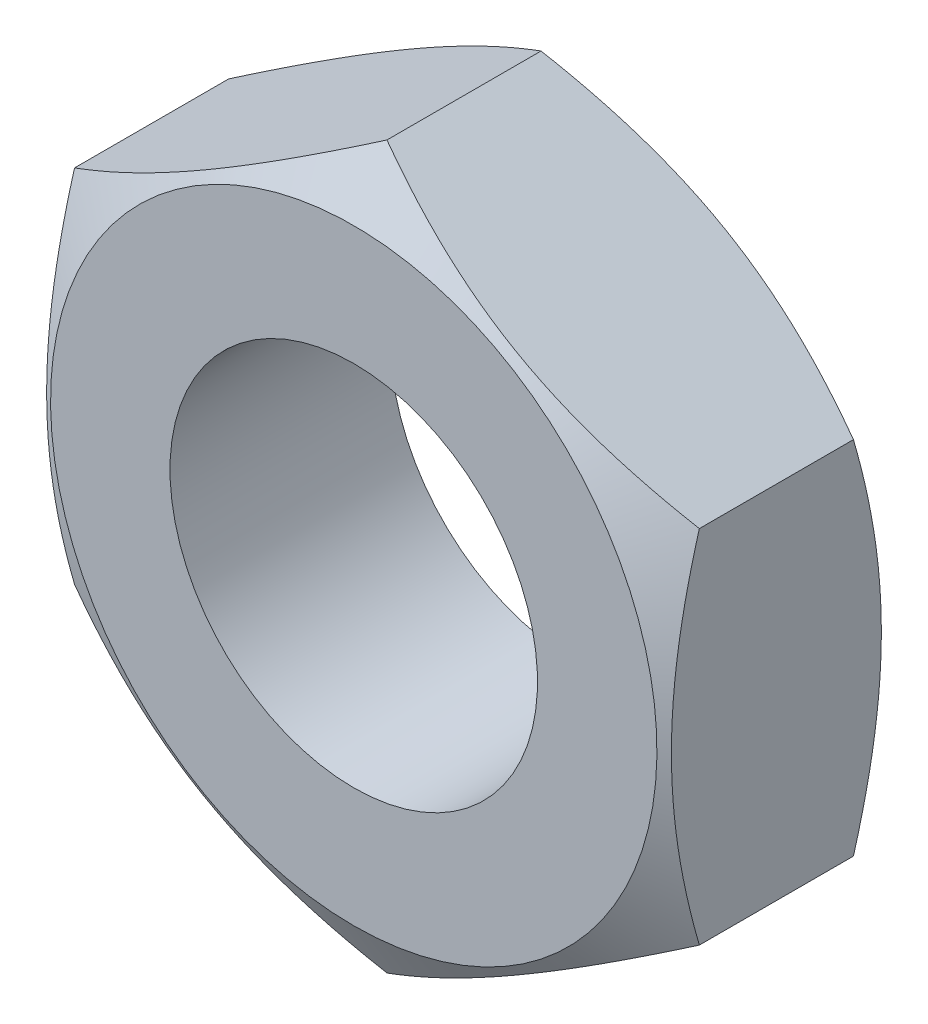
ISO-10303-21;
HEADER;
FILE_DESCRIPTION(('STEP AP214'),'2;1');
FILE_NAME('part.step','',(''),(''),'','','');
FILE_SCHEMA(('AUTOMOTIVE_DESIGN { 1 0 10303 214 1 1 1 1 }'));
ENDSEC;
DATA;
#1=APPLICATION_CONTEXT('core data for automotive mechanical design processes');
#2=APPLICATION_PROTOCOL_DEFINITION('international standard','automotive_design',2000,#1);
#3=PRODUCT_CONTEXT('',#1,'mechanical');
#4=PRODUCT('Part','Part','',(#3));
#5=PRODUCT_RELATED_PRODUCT_CATEGORY('part','',(#4));
#6=PRODUCT_DEFINITION_FORMATION('','',#4);
#7=PRODUCT_DEFINITION_CONTEXT('part definition',#1,'design');
#8=PRODUCT_DEFINITION('design','',#6,#7);
#9=PRODUCT_DEFINITION_SHAPE('','',#8);
#10=(LENGTH_UNIT() NAMED_UNIT(*) SI_UNIT(.MILLI.,.METRE.));
#11=(NAMED_UNIT(*) PLANE_ANGLE_UNIT() SI_UNIT($,.RADIAN.));
#12=(NAMED_UNIT(*) SI_UNIT($,.STERADIAN.) SOLID_ANGLE_UNIT());
#13=UNCERTAINTY_MEASURE_WITH_UNIT(LENGTH_MEASURE(1.E-05),#10,'distance_accuracy_value','');
#14=(GEOMETRIC_REPRESENTATION_CONTEXT(3) GLOBAL_UNCERTAINTY_ASSIGNED_CONTEXT((#13)) GLOBAL_UNIT_ASSIGNED_CONTEXT((#10,
#11,#12)) REPRESENTATION_CONTEXT('',''));
#15=CARTESIAN_POINT('',(0.,0.,0.));
#16=DIRECTION('',(0.,0.,1.));
#17=DIRECTION('',(1.,0.,0.));
#18=AXIS2_PLACEMENT_3D('',#15,#16,#17);
#19=CARTESIAN_POINT('',(-8.5,-4.90747728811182,8.));
#20=DIRECTION('',(-1.,0.,0.));
#21=DIRECTION('',(0.,0.,1.));
#22=AXIS2_PLACEMENT_3D('',#19,#20,#21);
#23=PLANE('',#22);
#24=CARTESIAN_POINT('',(-8.5,-13.2220103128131,1.68805373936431));
#25=CARTESIAN_POINT('',(-8.5,-12.8504235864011,1.86846678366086));
#26=CARTESIAN_POINT('',(-8.5,-12.4779881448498,2.04716148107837));
#27=CARTESIAN_POINT('',(-8.5,-11.7309686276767,2.40014855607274));
#28=CARTESIAN_POINT('',(-8.5,-11.356384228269,2.57444024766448));
#29=CARTESIAN_POINT('',(-8.5,-10.602704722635,2.91852400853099));
#30=CARTESIAN_POINT('',(-8.5,-10.2235961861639,3.08828676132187));
#31=CARTESIAN_POINT('',(-8.5,-9.46237784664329,3.42091824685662));
#32=CARTESIAN_POINT('',(-8.5,-9.08026818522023,3.5837873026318));
#33=CARTESIAN_POINT('',(-8.5,-8.29995060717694,3.90596922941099));
#34=CARTESIAN_POINT('',(-8.5,-7.90162321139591,4.06499431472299));
#35=CARTESIAN_POINT('',(-8.5,-7.10032398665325,4.37110535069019));
#36=CARTESIAN_POINT('',(-8.5,-6.69735164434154,4.51818996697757));
#37=CARTESIAN_POINT('',(-8.5,-5.88685796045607,4.79658764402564));
#38=CARTESIAN_POINT('',(-8.5,-5.47934758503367,4.927932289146));
#39=CARTESIAN_POINT('',(-8.5,-4.65849578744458,5.17066339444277));
#40=CARTESIAN_POINT('',(-8.5,-4.24515623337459,5.28205609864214));
#41=CARTESIAN_POINT('',(-8.5,-3.4146465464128,5.47896177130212));
#42=CARTESIAN_POINT('',(-8.5,-2.99751098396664,5.56461662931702));
#43=CARTESIAN_POINT('',(-8.5,-2.36797724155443,5.67010811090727));
#44=CARTESIAN_POINT('',(-8.5,-2.15747910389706,5.70144155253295));
#45=CARTESIAN_POINT('',(-8.5,-1.7354230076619,5.75583120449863));
#46=CARTESIAN_POINT('',(-8.5,-1.52386515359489,5.77888821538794));
#47=CARTESIAN_POINT('',(-8.5,-1.10275446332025,5.81597435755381));
#48=CARTESIAN_POINT('',(-8.5,-0.893211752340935,5.83011800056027));
#49=CARTESIAN_POINT('',(-8.5,-0.473715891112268,5.84952934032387));
#50=CARTESIAN_POINT('',(-8.5,-0.263762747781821,5.85479718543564));
#51=CARTESIAN_POINT('',(-8.5,0.156178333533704,5.85633113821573));
#52=CARTESIAN_POINT('',(-8.5,0.366166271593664,5.85259722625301));
#53=CARTESIAN_POINT('',(-8.5,0.785797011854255,5.83621947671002));
#54=CARTESIAN_POINT('',(-8.5,0.995439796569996,5.82357520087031));
#55=CARTESIAN_POINT('',(-8.5,1.49806512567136,5.78284710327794));
#56=CARTESIAN_POINT('',(-8.5,1.79071777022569,5.75060284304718));
#57=CARTESIAN_POINT('',(-8.5,2.37386344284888,5.6705007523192));
#58=CARTESIAN_POINT('',(-8.5,2.66435617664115,5.62264083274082));
#59=CARTESIAN_POINT('',(-8.5,3.53225535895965,5.45817427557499));
#60=CARTESIAN_POINT('',(-8.5,4.10576233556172,5.32071025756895));
#61=CARTESIAN_POINT('',(-8.5,4.96336295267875,5.08216925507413));
#62=CARTESIAN_POINT('',(-8.5,5.25190046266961,4.9961484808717));
#63=CARTESIAN_POINT('',(-8.5,5.82617341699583,4.81513030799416));
#64=CARTESIAN_POINT('',(-8.5,6.11190884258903,4.7201328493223));
#65=CARTESIAN_POINT('',(-8.5,6.68066668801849,4.52268903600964));
#66=CARTESIAN_POINT('',(-8.5,6.96368995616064,4.42024510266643));
#67=CARTESIAN_POINT('',(-8.5,7.52738867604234,4.2091179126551));
#68=CARTESIAN_POINT('',(-8.5,7.80806415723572,4.10043473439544));
#69=CARTESIAN_POINT('',(-8.5,8.47808910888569,3.83378477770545));
#70=CARTESIAN_POINT('',(-8.5,8.86645338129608,3.67334679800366));
#71=CARTESIAN_POINT('',(-8.5,9.63981277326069,3.34452258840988));
#72=CARTESIAN_POINT('',(-8.5,10.0248076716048,3.17613584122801));
#73=CARTESIAN_POINT('',(-8.5,10.7920682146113,2.83303130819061));
#74=CARTESIAN_POINT('',(-8.5,11.174333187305,2.65831202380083));
#75=CARTESIAN_POINT('',(-8.5,11.9365059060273,2.30384068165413));
#76=CARTESIAN_POINT('',(-8.5,12.3164137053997,2.12408873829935));
#77=CARTESIAN_POINT('',(-8.5,13.0747039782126,1.76030061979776));
#78=CARTESIAN_POINT('',(-8.5,13.4530842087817,1.57625977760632));
#79=CARTESIAN_POINT('',(-8.5,14.2081968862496,1.20482942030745));
#80=CARTESIAN_POINT('',(-8.5,14.5849293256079,1.01743988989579));
#81=CARTESIAN_POINT('',(-8.5,15.7129519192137,0.45120240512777));
#82=CARTESIAN_POINT('',(-8.5,16.4621734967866,0.068234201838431));
#83=CARTESIAN_POINT('',(-8.5,17.8924783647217,-0.672184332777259));
#84=CARTESIAN_POINT('',(-8.5,18.5738900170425,-1.02900322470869));
#85=CARTESIAN_POINT('',(-8.5,19.9341904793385,-1.74747618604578));
#86=CARTESIAN_POINT('',(-8.5,20.6130791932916,-2.10913043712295));
#87=CARTESIAN_POINT('',(-8.5,21.9671358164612,-2.83516945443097));
#88=CARTESIAN_POINT('',(-8.5,22.6423088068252,-3.19954475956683));
#89=CARTESIAN_POINT('',(-8.5,23.9910464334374,-3.93116924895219));
#90=CARTESIAN_POINT('',(-8.5,24.6646111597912,-4.29841826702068));
#91=CARTESIAN_POINT('',(-8.5,25.3375864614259,-4.66673700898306));
#92=B_SPLINE_CURVE_WITH_KNOTS('',3,(#24,#25,#26,#27,#28,#29,#30,#31,#32,#33,#34,#35,#36,#37,#38,
#39,#40,#41,#42,#43,#44,#45,#46,#47,#48,#49,#50,#51,#52,#53,#54,#55,#56,#57,#58,#59,#60,#61,#62,
#63,#64,#65,#66,#67,#68,#69,#70,#71,#72,#73,#74,#75,#76,#77,#78,#79,#80,#81,#82,#83,#84,#85,#86,
#87,#88,#89,#90,#91),.UNSPECIFIED.,.F.,.F.,(4,2,2,2,2,2,2,2,2,2,2,2,2,2,2,2,2,2,2,2,2,2,2,2,2,2,
2,2,2,2,2,2,2,4),(0.,1.23922034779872,2.47863258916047,3.72472525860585,4.97075947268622,
6.25730558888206,7.54399528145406,8.82805821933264,10.1117186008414,11.3881667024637,
12.0264818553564,12.6647352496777,13.2946121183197,13.9244784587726,14.5543461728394,
15.1842448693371,16.0670176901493,16.9499086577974,18.7166516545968,19.6198369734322,
20.5230283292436,21.425927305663,22.3288149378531,23.589291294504,24.8498497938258,
26.1107085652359,27.3715386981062,28.6338115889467,29.8960902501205,32.4202938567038,
34.7278204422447,37.0354339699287,39.3370893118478,41.6386125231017),.UNSPECIFIED.);
#93=CARTESIAN_POINT('',(-8.5,4.90747728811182,5.09647305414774));
#94=VERTEX_POINT('',#93);
#95=CARTESIAN_POINT('',(-8.5,-4.90747728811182,5.09647305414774));
#96=VERTEX_POINT('',#95);
#97=EDGE_CURVE('E74',#94,#96,#92,.F.);
#98=ORIENTED_EDGE('',*,*,#97,.F.);
#99=DIRECTION('',(0.,0.,-1.));
#100=VECTOR('',#99,1.);
#101=CARTESIAN_POINT('',(-8.5,4.90747728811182,8.));
#102=LINE('',#101,#100);
#103=CARTESIAN_POINT('',(-8.5,4.90747728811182,0.903526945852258));
#104=VERTEX_POINT('',#103);
#105=EDGE_CURVE('E43',#94,#104,#102,.T.);
#106=ORIENTED_EDGE('',*,*,#105,.T.);
#107=CARTESIAN_POINT('',(-8.5,-13.217348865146,4.30968253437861));
#108=CARTESIAN_POINT('',(-8.5,-12.8458016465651,4.1293073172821));
#109=CARTESIAN_POINT('',(-8.5,-12.4734053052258,3.95065142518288));
#110=CARTESIAN_POINT('',(-8.5,-11.7264629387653,3.59774455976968));
#111=CARTESIAN_POINT('',(-8.5,-11.3519165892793,3.42349427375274));
#112=CARTESIAN_POINT('',(-8.5,-10.598309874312,3.07949578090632));
#113=CARTESIAN_POINT('',(-8.5,-10.2192360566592,2.90977694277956));
#114=CARTESIAN_POINT('',(-8.5,-9.45808580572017,2.57723767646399));
#115=CARTESIAN_POINT('',(-8.5,-9.07600951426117,2.41441692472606));
#116=CARTESIAN_POINT('',(-8.5,-8.29577621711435,2.09234631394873));
#117=CARTESIAN_POINT('',(-8.5,-7.89749985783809,1.93338400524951));
#118=CARTESIAN_POINT('',(-8.5,-7.09630157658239,1.62740499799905));
#119=CARTESIAN_POINT('',(-8.5,-6.69337914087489,1.48038963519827));
#120=CARTESIAN_POINT('',(-8.5,-5.88298561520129,1.20213853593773));
#121=CARTESIAN_POINT('',(-8.5,-5.47552550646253,1.07087115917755));
#122=CARTESIAN_POINT('',(-8.5,-4.65477495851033,0.828303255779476));
#123=CARTESIAN_POINT('',(-8.5,-4.24148638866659,0.716996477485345));
#124=CARTESIAN_POINT('',(-8.5,-3.4110781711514,0.520269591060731));
#125=CARTESIAN_POINT('',(-8.5,-2.99399303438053,0.434707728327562));
#126=CARTESIAN_POINT('',(-8.5,-2.36453907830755,0.329359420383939));
#127=CARTESIAN_POINT('',(-8.5,-2.15406819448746,0.298074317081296));
#128=CARTESIAN_POINT('',(-8.5,-1.7320683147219,0.243781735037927));
#129=CARTESIAN_POINT('',(-8.5,-1.52053942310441,0.220773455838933));
#130=CARTESIAN_POINT('',(-8.5,-1.09948590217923,0.183783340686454));
#131=CARTESIAN_POINT('',(-8.5,-0.889971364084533,0.169687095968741));
#132=CARTESIAN_POINT('',(-8.5,-0.470533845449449,0.150369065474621));
#133=CARTESIAN_POINT('',(-8.5,-0.260610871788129,0.145147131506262));
#134=CARTESIAN_POINT('',(-8.5,0.159267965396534,0.143702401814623));
#135=CARTESIAN_POINT('',(-8.5,0.369223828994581,0.147479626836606));
#136=CARTESIAN_POINT('',(-8.5,0.788788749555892,0.163940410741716));
#137=CARTESIAN_POINT('',(-8.5,0.998397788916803,0.176624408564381));
#138=CARTESIAN_POINT('',(-8.5,1.50108256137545,0.217454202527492));
#139=CARTESIAN_POINT('',(-8.5,1.793827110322,0.249766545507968));
#140=CARTESIAN_POINT('',(-8.5,2.37715285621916,0.330009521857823));
#141=CARTESIAN_POINT('',(-8.5,2.66773375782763,0.377942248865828));
#142=CARTESIAN_POINT('',(-8.5,3.53589346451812,0.542630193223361));
#143=CARTESIAN_POINT('',(-8.5,4.10956801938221,0.680245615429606));
#144=CARTESIAN_POINT('',(-8.5,4.96741250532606,0.919010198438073));
#145=CARTESIAN_POINT('',(-8.5,5.25602859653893,1.00510487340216));
#146=CARTESIAN_POINT('',(-8.5,5.83045786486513,1.18626877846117));
#147=CARTESIAN_POINT('',(-8.5,6.11627102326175,1.28133806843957));
#148=CARTESIAN_POINT('',(-8.5,6.68518369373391,1.47892313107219));
#149=CARTESIAN_POINT('',(-8.5,6.96828405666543,1.58143647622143));
#150=CARTESIAN_POINT('',(-8.5,7.53213698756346,1.79270023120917));
#151=CARTESIAN_POINT('',(-8.5,7.81288958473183,1.90145056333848));
#152=CARTESIAN_POINT('',(-8.5,8.48212780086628,2.1678721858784));
#153=CARTESIAN_POINT('',(-8.5,8.86963833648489,2.32798850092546));
#154=CARTESIAN_POINT('',(-8.5,9.64130597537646,2.65613130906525));
#155=CARTESIAN_POINT('',(-8.5,10.0254628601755,2.82415831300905));
#156=CARTESIAN_POINT('',(-8.5,10.7910586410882,3.16651606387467));
#157=CARTESIAN_POINT('',(-8.5,11.172496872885,3.34084829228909));
#158=CARTESIAN_POINT('',(-8.5,11.9330253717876,3.69452635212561));
#159=CARTESIAN_POINT('',(-8.5,12.3121156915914,3.87387207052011));
#160=CARTESIAN_POINT('',(-8.5,13.0687747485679,4.23683235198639));
#161=CARTESIAN_POINT('',(-8.5,13.4463412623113,4.42045154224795));
#162=CARTESIAN_POINT('',(-8.5,14.1998317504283,4.7910284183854));
#163=CARTESIAN_POINT('',(-8.5,14.5757557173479,4.9779861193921));
#164=CARTESIAN_POINT('',(-8.5,15.7013597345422,5.54291756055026));
#165=CARTESIAN_POINT('',(-8.5,16.448977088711,5.92500052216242));
#166=CARTESIAN_POINT('',(-8.5,17.8763952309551,6.6637998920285));
#167=CARTESIAN_POINT('',(-8.5,18.5565227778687,7.01988783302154));
#168=CARTESIAN_POINT('',(-8.5,19.9142584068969,7.73689269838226));
#169=CARTESIAN_POINT('',(-8.5,20.5918663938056,8.09780980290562));
#170=CARTESIAN_POINT('',(-8.5,21.9433746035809,8.82237697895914));
#171=CARTESIAN_POINT('',(-8.5,22.6172798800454,9.18601763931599));
#172=CARTESIAN_POINT('',(-8.5,23.963483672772,9.91617087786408));
#173=CARTESIAN_POINT('',(-8.5,24.6357822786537,10.2826832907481));
#174=CARTESIAN_POINT('',(-8.5,25.3074917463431,10.6502650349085));
#175=B_SPLINE_CURVE_WITH_KNOTS('',3,(#107,#108,#109,#110,#111,#112,#113,#114,#115,#116,#117,
#118,#119,#120,#121,#122,#123,#124,#125,#126,#127,#128,#129,#130,#131,#132,#133,#134,#135,#136,
#137,#138,#139,#140,#141,#142,#143,#144,#145,#146,#147,#148,#149,#150,#151,#152,#153,#154,#155,
#156,#157,#158,#159,#160,#161,#162,#163,#164,#165,#166,#167,#168,#169,#170,#171,#172,#173,#174),
.UNSPECIFIED.,.F.,.F.,(4,2,2,2,2,2,2,2,2,2,2,2,2,2,2,2,2,2,2,2,2,2,2,2,2,2,2,2,2,2,2,2,2,4),(0.,
1.23906418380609,2.47832048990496,3.7242641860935,4.97014937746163,6.25648329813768,
7.54296084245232,8.82680874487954,10.1102538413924,11.3864970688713,12.0247099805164,
12.6628611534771,13.2926441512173,13.9224166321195,14.5521905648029,15.1819955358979,
16.0650645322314,16.9482519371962,18.7155902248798,19.6190649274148,20.5225456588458,
21.4257330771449,22.3289092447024,23.5866510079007,24.8444741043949,26.1025946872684,
27.3606869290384,28.6202113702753,29.8797415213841,32.3984513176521,34.7015479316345,
37.0047307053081,39.3019924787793,41.599122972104),.UNSPECIFIED.);
#176=CARTESIAN_POINT('',(-8.5,-4.90747728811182,0.903526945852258));
#177=VERTEX_POINT('',#176);
#178=EDGE_CURVE('E92',#177,#104,#175,.T.);
#179=ORIENTED_EDGE('',*,*,#178,.F.);
#180=DIRECTION('',(0.,0.,-1.));
#181=VECTOR('',#180,1.);
#182=CARTESIAN_POINT('',(-8.5,-4.90747728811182,8.));
#183=LINE('',#182,#181);
#184=EDGE_CURVE('E29',#96,#177,#183,.T.);
#185=ORIENTED_EDGE('',*,*,#184,.F.);
#186=EDGE_LOOP('',(#98,#106,#179,#185));
#187=FACE_BOUND('',#186,.T.);
#188=ADVANCED_FACE('F14',(#187),#23,.T.);
#189=CARTESIAN_POINT('',(-8.5,-4.90747728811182,8.));
#190=DIRECTION('',(0.5,0.866025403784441,0.));
#191=DIRECTION('',(-0.866025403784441,0.5,0.));
#192=AXIS2_PLACEMENT_3D('',#189,#190,#191);
#193=PLANE('',#192);
#194=DIRECTION('',(0.,0.,-1.));
#195=VECTOR('',#194,1.);
#196=CARTESIAN_POINT('',(0.,-9.81495457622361,8.));
#197=LINE('',#196,#195);
#198=CARTESIAN_POINT('',(0.,-9.81495457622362,5.09647305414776));
#199=VERTEX_POINT('',#198);
#200=CARTESIAN_POINT('',(0.,-9.81495457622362,0.903526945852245));
#201=VERTEX_POINT('',#200);
#202=EDGE_CURVE('E99',#199,#201,#197,.T.);
#203=ORIENTED_EDGE('',*,*,#202,.F.);
#204=CARTESIAN_POINT('',(0.000200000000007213,-9.81507004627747,5.09640638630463));
#205=CARTESIAN_POINT('',(-0.186639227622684,-9.70719836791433,5.15867629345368));
#206=CARTESIAN_POINT('',(-0.37417505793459,-9.59892450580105,5.21812013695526));
#207=CARTESIAN_POINT('',(-0.750769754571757,-9.38149745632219,5.33057732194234));
#208=CARTESIAN_POINT('',(-0.939829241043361,-9.27234391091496,5.38358788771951));
#209=CARTESIAN_POINT('',(-1.51003475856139,-8.94313560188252,5.53192904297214));
#210=CARTESIAN_POINT('',(-1.89343164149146,-8.72178130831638,5.61630350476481));
#211=CARTESIAN_POINT('',(-2.46717766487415,-8.39052888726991,5.71524241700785));
#212=CARTESIAN_POINT('',(-2.65581276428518,-8.28162036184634,5.7434272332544));
#213=CARTESIAN_POINT('',(-3.03393602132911,-8.06331079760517,5.7906883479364));
#214=CARTESIAN_POINT('',(-3.22342410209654,-7.95390980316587,5.80976545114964));
#215=CARTESIAN_POINT('',(-3.6027265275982,-7.73491944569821,5.8383276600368));
#216=CARTESIAN_POINT('',(-3.79254025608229,-7.62533043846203,5.84782365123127));
#217=CARTESIAN_POINT('',(-4.17234305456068,-7.40605119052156,5.85702005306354));
#218=CARTESIAN_POINT('',(-4.36233211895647,-7.29636095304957,5.85672076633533));
#219=CARTESIAN_POINT('',(-4.71752301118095,-7.09129139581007,5.84700795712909));
#220=CARTESIAN_POINT('',(-4.8827499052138,-6.99589760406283,5.83877926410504));
#221=CARTESIAN_POINT('',(-5.21281671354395,-6.80533344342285,5.81507319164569));
#222=CARTESIAN_POINT('',(-5.37765660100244,-6.71016309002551,5.79959532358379));
#223=CARTESIAN_POINT('',(-5.87153810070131,-6.42502047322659,5.74265381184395));
#224=CARTESIAN_POINT('',(-6.19970550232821,-6.23555293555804,5.69068937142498));
#225=CARTESIAN_POINT('',(-6.85952142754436,-5.8546080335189,5.56077749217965));
#226=CARTESIAN_POINT('',(-7.19108574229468,-5.66317928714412,5.48227936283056));
#227=CARTESIAN_POINT('',(-7.84926989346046,-5.28317649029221,5.30412109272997));
#228=CARTESIAN_POINT('',(-8.17589815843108,-5.09459757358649,5.20450279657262));
#229=CARTESIAN_POINT('',(-8.5002,-4.90736181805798,5.09640638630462));
#230=B_SPLINE_CURVE_WITH_KNOTS('',3,(#204,#205,#206,#207,#208,#209,#210,#211,#212,#213,#214,
#215,#216,#217,#218,#219,#220,#221,#222,#223,#224,#225,#226,#227,#228,#229),.UNSPECIFIED.,.F.,
.F.,(4,2,2,2,2,2,2,2,2,2,2,2,4),(0.,0.673596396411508,1.34748239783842,2.69805431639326,
3.356799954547,4.01548737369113,4.67342558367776,5.33134346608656,5.9040955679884,
6.47688628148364,7.62328361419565,8.79510569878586,9.96462743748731),.UNSPECIFIED.);
#231=EDGE_CURVE('E80',#199,#96,#230,.T.);
#232=ORIENTED_EDGE('',*,*,#231,.T.);
#233=ORIENTED_EDGE('',*,*,#184,.T.);
#234=CARTESIAN_POINT('',(-8.5002,-4.90736181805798,0.90359361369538));
#235=CARTESIAN_POINT('',(-8.31336077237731,-5.01523349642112,0.841323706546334));
#236=CARTESIAN_POINT('',(-8.1258249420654,-5.1235073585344,0.781879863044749));
#237=CARTESIAN_POINT('',(-7.74923024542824,-5.34093440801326,0.669422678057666));
#238=CARTESIAN_POINT('',(-7.56017075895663,-5.45008795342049,0.616412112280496));
#239=CARTESIAN_POINT('',(-6.9899652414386,-5.77929626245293,0.468070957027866));
#240=CARTESIAN_POINT('',(-6.60656835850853,-6.00065055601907,0.383696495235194));
#241=CARTESIAN_POINT('',(-6.03282233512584,-6.33190297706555,0.284757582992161));
#242=CARTESIAN_POINT('',(-5.84418723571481,-6.44081150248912,0.256572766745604));
#243=CARTESIAN_POINT('',(-5.46606397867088,-6.65912106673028,0.209311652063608));
#244=CARTESIAN_POINT('',(-5.27657589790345,-6.76852206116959,0.190234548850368));
#245=CARTESIAN_POINT('',(-4.89727347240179,-6.98751241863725,0.161672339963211));
#246=CARTESIAN_POINT('',(-4.7074597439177,-7.09710142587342,0.15217634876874));
#247=CARTESIAN_POINT('',(-4.32765694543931,-7.3163806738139,0.14297994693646));
#248=CARTESIAN_POINT('',(-4.13766788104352,-7.42607091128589,0.143279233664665));
#249=CARTESIAN_POINT('',(-3.78247698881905,-7.63114046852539,0.15299204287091));
#250=CARTESIAN_POINT('',(-3.6172500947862,-7.72653426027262,0.161220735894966));
#251=CARTESIAN_POINT('',(-3.28718328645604,-7.9170984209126,0.184926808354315));
#252=CARTESIAN_POINT('',(-3.12234339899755,-8.01226877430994,0.200404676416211));
#253=CARTESIAN_POINT('',(-2.62846189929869,-8.29741139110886,0.257346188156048));
#254=CARTESIAN_POINT('',(-2.30029449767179,-8.48687892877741,0.309310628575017));
#255=CARTESIAN_POINT('',(-1.64047857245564,-8.86782383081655,0.439222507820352));
#256=CARTESIAN_POINT('',(-1.30891425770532,-9.05925257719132,0.517720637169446));
#257=CARTESIAN_POINT('',(-0.650730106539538,-9.43925537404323,0.695878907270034));
#258=CARTESIAN_POINT('',(-0.324101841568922,-9.62783429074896,0.79549720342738));
#259=CARTESIAN_POINT('',(0.000199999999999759,-9.81507004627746,0.903593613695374));
#260=B_SPLINE_CURVE_WITH_KNOTS('',3,(#234,#235,#236,#237,#238,#239,#240,#241,#242,#243,#244,
#245,#246,#247,#248,#249,#250,#251,#252,#253,#254,#255,#256,#257,#258,#259),.UNSPECIFIED.,.F.,
.F.,(4,2,2,2,2,2,2,2,2,2,2,2,4),(0.,0.673596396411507,1.34748239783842,2.69805431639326,
3.356799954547,4.01548737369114,4.67342558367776,5.33134346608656,5.9040955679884,
6.47688628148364,7.62328361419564,8.79510569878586,9.96462743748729),.UNSPECIFIED.);
#261=EDGE_CURVE('E164',#177,#201,#260,.T.);
#262=ORIENTED_EDGE('',*,*,#261,.T.);
#263=EDGE_LOOP('',(#203,#232,#233,#262));
#264=FACE_BOUND('',#263,.T.);
#265=ADVANCED_FACE('F16',(#264),#193,.F.);
#266=CARTESIAN_POINT('',(8.5,-4.90747728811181,8.));
#267=DIRECTION('',(0.5,-0.86602540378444,0.));
#268=DIRECTION('',(0.86602540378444,0.5,0.));
#269=AXIS2_PLACEMENT_3D('',#266,#267,#268);
#270=PLANE('',#269);
#271=CARTESIAN_POINT('',(-0.000199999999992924,-9.81507004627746,5.09640638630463));
#272=CARTESIAN_POINT('',(0.186639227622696,-9.70719836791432,5.15867629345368));
#273=CARTESIAN_POINT('',(0.374175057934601,-9.59892450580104,5.21812013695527));
#274=CARTESIAN_POINT('',(0.750769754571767,-9.38149745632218,5.33057732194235));
#275=CARTESIAN_POINT('',(0.939829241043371,-9.27234391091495,5.38358788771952));
#276=CARTESIAN_POINT('',(1.5100347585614,-8.94313560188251,5.53192904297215));
#277=CARTESIAN_POINT('',(1.89343164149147,-8.72178130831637,5.61630350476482));
#278=CARTESIAN_POINT('',(2.46717766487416,-8.39052888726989,5.71524241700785));
#279=CARTESIAN_POINT('',(2.65581276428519,-8.28162036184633,5.74342723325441));
#280=CARTESIAN_POINT('',(3.03393602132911,-8.06331079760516,5.7906883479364));
#281=CARTESIAN_POINT('',(3.22342410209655,-7.95390980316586,5.80976545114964));
#282=CARTESIAN_POINT('',(3.60272652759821,-7.7349194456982,5.8383276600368));
#283=CARTESIAN_POINT('',(3.7925402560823,-7.62533043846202,5.84782365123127));
#284=CARTESIAN_POINT('',(4.17234305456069,-7.40605119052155,5.85702005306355));
#285=CARTESIAN_POINT('',(4.36233211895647,-7.29636095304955,5.85672076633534));
#286=CARTESIAN_POINT('',(4.71752301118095,-7.09129139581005,5.8470079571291));
#287=CARTESIAN_POINT('',(4.8827499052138,-6.99589760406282,5.83877926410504));
#288=CARTESIAN_POINT('',(5.21281671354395,-6.80533344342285,5.81507319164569));
#289=CARTESIAN_POINT('',(5.37765660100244,-6.7101630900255,5.7995953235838));
#290=CARTESIAN_POINT('',(5.87153810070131,-6.42502047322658,5.74265381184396));
#291=CARTESIAN_POINT('',(6.19970550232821,-6.23555293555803,5.69068937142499));
#292=CARTESIAN_POINT('',(6.85952142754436,-5.85460803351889,5.56077749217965));
#293=CARTESIAN_POINT('',(7.19108574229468,-5.66317928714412,5.48227936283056));
#294=CARTESIAN_POINT('',(7.84926989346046,-5.2831764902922,5.30412109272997));
#295=CARTESIAN_POINT('',(8.17589815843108,-5.09459757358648,5.20450279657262));
#296=CARTESIAN_POINT('',(8.5002,-4.90736181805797,5.09640638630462));
#297=B_SPLINE_CURVE_WITH_KNOTS('',3,(#271,#272,#273,#274,#275,#276,#277,#278,#279,#280,#281,
#282,#283,#284,#285,#286,#287,#288,#289,#290,#291,#292,#293,#294,#295,#296),.UNSPECIFIED.,.F.,
.F.,(4,2,2,2,2,2,2,2,2,2,2,2,4),(0.,0.673596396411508,1.34748239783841,2.69805431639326,
3.356799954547,4.01548737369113,4.67342558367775,5.33134346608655,5.90409556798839,
6.47688628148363,7.62328361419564,8.79510569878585,9.96462743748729),.UNSPECIFIED.);
#298=CARTESIAN_POINT('',(8.5,-4.90747728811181,5.09647305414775));
#299=VERTEX_POINT('',#298);
#300=EDGE_CURVE('E135',#199,#299,#297,.T.);
#301=ORIENTED_EDGE('',*,*,#300,.F.);
#302=ORIENTED_EDGE('',*,*,#202,.T.);
#303=CARTESIAN_POINT('',(8.5002,-4.90736181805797,0.903593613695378));
#304=CARTESIAN_POINT('',(8.31336077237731,-5.01523349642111,0.841323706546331));
#305=CARTESIAN_POINT('',(8.1258249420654,-5.12350735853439,0.781879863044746));
#306=CARTESIAN_POINT('',(7.74923024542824,-5.34093440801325,0.669422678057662));
#307=CARTESIAN_POINT('',(7.56017075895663,-5.45008795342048,0.616412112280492));
#308=CARTESIAN_POINT('',(6.9899652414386,-5.77929626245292,0.468070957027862));
#309=CARTESIAN_POINT('',(6.60656835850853,-6.00065055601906,0.38369649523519));
#310=CARTESIAN_POINT('',(6.03282233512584,-6.33190297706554,0.284757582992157));
#311=CARTESIAN_POINT('',(5.84418723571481,-6.44081150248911,0.2565727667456));
#312=CARTESIAN_POINT('',(5.46606397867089,-6.65912106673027,0.209311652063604));
#313=CARTESIAN_POINT('',(5.27657589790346,-6.76852206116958,0.190234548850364));
#314=CARTESIAN_POINT('',(4.8972734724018,-6.98751241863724,0.161672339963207));
#315=CARTESIAN_POINT('',(4.7074597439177,-7.09710142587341,0.152176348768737));
#316=CARTESIAN_POINT('',(4.32765694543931,-7.31638067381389,0.142979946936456));
#317=CARTESIAN_POINT('',(4.13766788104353,-7.42607091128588,0.143279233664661));
#318=CARTESIAN_POINT('',(3.78247698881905,-7.63114046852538,0.152992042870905));
#319=CARTESIAN_POINT('',(3.6172500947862,-7.72653426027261,0.161220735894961));
#320=CARTESIAN_POINT('',(3.28718328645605,-7.91709842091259,0.18492680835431));
#321=CARTESIAN_POINT('',(3.12234339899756,-8.01226877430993,0.200404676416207));
#322=CARTESIAN_POINT('',(2.62846189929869,-8.29741139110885,0.257346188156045));
#323=CARTESIAN_POINT('',(2.30029449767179,-8.4868789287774,0.309310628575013));
#324=CARTESIAN_POINT('',(1.64047857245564,-8.86782383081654,0.439222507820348));
#325=CARTESIAN_POINT('',(1.30891425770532,-9.05925257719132,0.517720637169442));
#326=CARTESIAN_POINT('',(0.650730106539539,-9.43925537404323,0.695878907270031));
#327=CARTESIAN_POINT('',(0.324101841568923,-9.62783429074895,0.795497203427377));
#328=CARTESIAN_POINT('',(-0.000199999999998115,-9.81507004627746,0.903593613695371));
#329=B_SPLINE_CURVE_WITH_KNOTS('',3,(#303,#304,#305,#306,#307,#308,#309,#310,#311,#312,#313,
#314,#315,#316,#317,#318,#319,#320,#321,#322,#323,#324,#325,#326,#327,#328),.UNSPECIFIED.,.F.,
.F.,(4,2,2,2,2,2,2,2,2,2,2,2,4),(0.,0.673596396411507,1.34748239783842,2.69805431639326,
3.356799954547,4.01548737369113,4.67342558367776,5.33134346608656,5.9040955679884,
6.47688628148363,7.62328361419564,8.79510569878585,9.96462743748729),.UNSPECIFIED.);
#330=CARTESIAN_POINT('',(8.5,-4.90747728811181,0.903526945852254));
#331=VERTEX_POINT('',#330);
#332=EDGE_CURVE('E196',#331,#201,#329,.T.);
#333=ORIENTED_EDGE('',*,*,#332,.F.);
#334=DIRECTION('',(0.,0.,-1.));
#335=VECTOR('',#334,1.);
#336=CARTESIAN_POINT('',(8.5,-4.90747728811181,8.));
#337=LINE('',#336,#335);
#338=EDGE_CURVE('E97',#299,#331,#337,.T.);
#339=ORIENTED_EDGE('',*,*,#338,.F.);
#340=EDGE_LOOP('',(#301,#302,#333,#339));
#341=FACE_BOUND('',#340,.T.);
#342=ADVANCED_FACE('F202',(#341),#270,.T.);
#343=CARTESIAN_POINT('',(8.5,-4.90747728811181,8.));
#344=DIRECTION('',(-1.,0.,0.));
#345=DIRECTION('',(0.,0.,1.));
#346=AXIS2_PLACEMENT_3D('',#343,#344,#345);
#347=PLANE('',#346);
#348=DIRECTION('',(0.,0.,-1.));
#349=VECTOR('',#348,1.);
#350=CARTESIAN_POINT('',(8.5,4.90747728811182,8.));
#351=LINE('',#350,#349);
#352=CARTESIAN_POINT('',(8.5,4.90747728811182,5.09647305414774));
#353=VERTEX_POINT('',#352);
#354=CARTESIAN_POINT('',(8.5,4.90747728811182,0.903526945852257));
#355=VERTEX_POINT('',#354);
#356=EDGE_CURVE('E89',#353,#355,#351,.T.);
#357=ORIENTED_EDGE('',*,*,#356,.F.);
#358=CARTESIAN_POINT('',(8.5,-13.2220103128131,1.68805373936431));
#359=CARTESIAN_POINT('',(8.5,-12.8504235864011,1.86846678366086));
#360=CARTESIAN_POINT('',(8.5,-12.4779881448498,2.04716148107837));
#361=CARTESIAN_POINT('',(8.5,-11.7309686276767,2.40014855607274));
#362=CARTESIAN_POINT('',(8.5,-11.356384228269,2.57444024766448));
#363=CARTESIAN_POINT('',(8.5,-10.602704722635,2.91852400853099));
#364=CARTESIAN_POINT('',(8.5,-10.2235961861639,3.08828676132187));
#365=CARTESIAN_POINT('',(8.5,-9.46237784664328,3.42091824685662));
#366=CARTESIAN_POINT('',(8.5,-9.08026818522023,3.5837873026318));
#367=CARTESIAN_POINT('',(8.5,-8.29995060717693,3.90596922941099));
#368=CARTESIAN_POINT('',(8.5,-7.90162321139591,4.064994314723));
#369=CARTESIAN_POINT('',(8.5,-7.10032398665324,4.37110535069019));
#370=CARTESIAN_POINT('',(8.5,-6.69735164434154,4.51818996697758));
#371=CARTESIAN_POINT('',(8.5,-5.88685796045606,4.79658764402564));
#372=CARTESIAN_POINT('',(8.5,-5.47934758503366,4.927932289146));
#373=CARTESIAN_POINT('',(8.5,-4.65849578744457,5.17066339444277));
#374=CARTESIAN_POINT('',(8.5,-4.24515623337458,5.28205609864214));
#375=CARTESIAN_POINT('',(8.5,-3.41464654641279,5.47896177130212));
#376=CARTESIAN_POINT('',(8.5,-2.99751098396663,5.56461662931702));
#377=CARTESIAN_POINT('',(8.5,-2.36797724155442,5.67010811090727));
#378=CARTESIAN_POINT('',(8.5,-2.15747910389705,5.70144155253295));
#379=CARTESIAN_POINT('',(8.5,-1.73542300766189,5.75583120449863));
#380=CARTESIAN_POINT('',(8.5,-1.52386515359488,5.77888821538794));
#381=CARTESIAN_POINT('',(8.5,-1.10275446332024,5.81597435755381));
#382=CARTESIAN_POINT('',(8.5,-0.893211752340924,5.83011800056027));
#383=CARTESIAN_POINT('',(8.5,-0.473715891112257,5.84952934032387));
#384=CARTESIAN_POINT('',(8.5,-0.26376274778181,5.85479718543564));
#385=CARTESIAN_POINT('',(8.5,0.156178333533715,5.85633113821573));
#386=CARTESIAN_POINT('',(8.5,0.366166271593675,5.85259722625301));
#387=CARTESIAN_POINT('',(8.5,0.785797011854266,5.83621947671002));
#388=CARTESIAN_POINT('',(8.5,0.995439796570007,5.82357520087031));
#389=CARTESIAN_POINT('',(8.5,1.49806512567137,5.78284710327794));
#390=CARTESIAN_POINT('',(8.5,1.7907177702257,5.75060284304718));
#391=CARTESIAN_POINT('',(8.5,2.37386344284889,5.6705007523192));
#392=CARTESIAN_POINT('',(8.5,2.66435617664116,5.62264083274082));
#393=CARTESIAN_POINT('',(8.5,3.53225535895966,5.45817427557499));
#394=CARTESIAN_POINT('',(8.5,4.10576233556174,5.32071025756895));
#395=CARTESIAN_POINT('',(8.5,4.96336295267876,5.08216925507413));
#396=CARTESIAN_POINT('',(8.5,5.25190046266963,4.99614848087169));
#397=CARTESIAN_POINT('',(8.5,5.82617341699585,4.81513030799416));
#398=CARTESIAN_POINT('',(8.5,6.11190884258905,4.72013284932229));
#399=CARTESIAN_POINT('',(8.5,6.68066668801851,4.52268903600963));
#400=CARTESIAN_POINT('',(8.5,6.96368995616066,4.42024510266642));
#401=CARTESIAN_POINT('',(8.5,7.52738867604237,4.20911791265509));
#402=CARTESIAN_POINT('',(8.5,7.80806415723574,4.10043473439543));
#403=CARTESIAN_POINT('',(8.5,8.47808910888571,3.83378477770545));
#404=CARTESIAN_POINT('',(8.5,8.8664533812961,3.67334679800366));
#405=CARTESIAN_POINT('',(8.5,9.63981277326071,3.34452258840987));
#406=CARTESIAN_POINT('',(8.5,10.0248076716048,3.17613584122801));
#407=CARTESIAN_POINT('',(8.5,10.7920682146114,2.83303130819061));
#408=CARTESIAN_POINT('',(8.5,11.174333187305,2.65831202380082));
#409=CARTESIAN_POINT('',(8.5,11.9365059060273,2.30384068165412));
#410=CARTESIAN_POINT('',(8.5,12.3164137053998,2.12408873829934));
#411=CARTESIAN_POINT('',(8.5,13.0747039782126,1.76030061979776));
#412=CARTESIAN_POINT('',(8.5,13.4530842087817,1.57625977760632));
#413=CARTESIAN_POINT('',(8.5,14.2081968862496,1.20482942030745));
#414=CARTESIAN_POINT('',(8.5,14.5849293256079,1.01743988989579));
#415=CARTESIAN_POINT('',(8.5,15.7129519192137,0.451202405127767));
#416=CARTESIAN_POINT('',(8.5,16.4621734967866,0.0682342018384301));
#417=CARTESIAN_POINT('',(8.5,17.8924783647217,-0.672184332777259));
#418=CARTESIAN_POINT('',(8.5,18.5738900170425,-1.02900322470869));
#419=CARTESIAN_POINT('',(8.5,19.9341904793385,-1.74747618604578));
#420=CARTESIAN_POINT('',(8.5,20.6130791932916,-2.10913043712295));
#421=CARTESIAN_POINT('',(8.5,21.9671358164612,-2.83516945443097));
#422=CARTESIAN_POINT('',(8.5,22.6423088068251,-3.19954475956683));
#423=CARTESIAN_POINT('',(8.5,23.9910464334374,-3.93116924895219));
#424=CARTESIAN_POINT('',(8.5,24.6646111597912,-4.29841826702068));
#425=CARTESIAN_POINT('',(8.5,25.3375864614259,-4.66673700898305));
#426=B_SPLINE_CURVE_WITH_KNOTS('',3,(#358,#359,#360,#361,#362,#363,#364,#365,#366,#367,#368,
#369,#370,#371,#372,#373,#374,#375,#376,#377,#378,#379,#380,#381,#382,#383,#384,#385,#386,#387,
#388,#389,#390,#391,#392,#393,#394,#395,#396,#397,#398,#399,#400,#401,#402,#403,#404,#405,#406,
#407,#408,#409,#410,#411,#412,#413,#414,#415,#416,#417,#418,#419,#420,#421,#422,#423,#424,#425),
.UNSPECIFIED.,.F.,.F.,(4,2,2,2,2,2,2,2,2,2,2,2,2,2,2,2,2,2,2,2,2,2,2,2,2,2,2,2,2,2,2,2,2,4),(0.,
1.23922034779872,2.47863258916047,3.72472525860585,4.97075947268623,6.25730558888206,
7.54399528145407,8.82805821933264,10.1117186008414,11.3881667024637,12.0264818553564,
12.6647352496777,13.2946121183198,13.9244784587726,14.5543461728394,15.1842448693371,
16.0670176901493,16.9499086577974,18.7166516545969,19.6198369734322,20.5230283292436,
21.4259273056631,22.3288149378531,23.589291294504,24.8498497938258,26.1107085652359,
27.3715386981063,28.6338115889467,29.8960902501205,32.4202938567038,34.7278204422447,
37.0354339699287,39.3370893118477,41.6386125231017),.UNSPECIFIED.);
#427=EDGE_CURVE('E106',#353,#299,#426,.F.);
#428=ORIENTED_EDGE('',*,*,#427,.T.);
#429=ORIENTED_EDGE('',*,*,#338,.T.);
#430=CARTESIAN_POINT('',(8.5,-13.217348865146,4.3096825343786));
#431=CARTESIAN_POINT('',(8.5,-12.8458016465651,4.1293073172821));
#432=CARTESIAN_POINT('',(8.5,-12.4734053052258,3.95065142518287));
#433=CARTESIAN_POINT('',(8.5,-11.7264629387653,3.59774455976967));
#434=CARTESIAN_POINT('',(8.5,-11.3519165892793,3.42349427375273));
#435=CARTESIAN_POINT('',(8.5,-10.5983098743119,3.07949578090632));
#436=CARTESIAN_POINT('',(8.5,-10.2192360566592,2.90977694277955));
#437=CARTESIAN_POINT('',(8.5,-9.45808580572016,2.57723767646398));
#438=CARTESIAN_POINT('',(8.5,-9.07600951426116,2.41441692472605));
#439=CARTESIAN_POINT('',(8.5,-8.29577621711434,2.09234631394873));
#440=CARTESIAN_POINT('',(8.5,-7.89749985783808,1.9333840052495));
#441=CARTESIAN_POINT('',(8.5,-7.09630157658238,1.62740499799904));
#442=CARTESIAN_POINT('',(8.5,-6.69337914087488,1.48038963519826));
#443=CARTESIAN_POINT('',(8.5,-5.88298561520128,1.20213853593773));
#444=CARTESIAN_POINT('',(8.5,-5.47552550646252,1.07087115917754));
#445=CARTESIAN_POINT('',(8.5,-4.65477495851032,0.828303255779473));
#446=CARTESIAN_POINT('',(8.5,-4.24148638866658,0.716996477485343));
#447=CARTESIAN_POINT('',(8.5,-3.41107817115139,0.520269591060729));
#448=CARTESIAN_POINT('',(8.5,-2.99399303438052,0.43470772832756));
#449=CARTESIAN_POINT('',(8.5,-2.36453907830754,0.329359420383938));
#450=CARTESIAN_POINT('',(8.5,-2.15406819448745,0.298074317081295));
#451=CARTESIAN_POINT('',(8.5,-1.73206831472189,0.243781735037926));
#452=CARTESIAN_POINT('',(8.5,-1.5205394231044,0.220773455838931));
#453=CARTESIAN_POINT('',(8.5,-1.09948590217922,0.183783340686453));
#454=CARTESIAN_POINT('',(8.5,-0.889971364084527,0.169687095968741));
#455=CARTESIAN_POINT('',(8.5,-0.470533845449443,0.150369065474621));
#456=CARTESIAN_POINT('',(8.5,-0.260610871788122,0.145147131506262));
#457=CARTESIAN_POINT('',(8.5,0.159267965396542,0.143702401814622));
#458=CARTESIAN_POINT('',(8.5,0.36922382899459,0.147479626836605));
#459=CARTESIAN_POINT('',(8.5,0.7887887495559,0.163940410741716));
#460=CARTESIAN_POINT('',(8.5,0.998397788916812,0.176624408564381));
#461=CARTESIAN_POINT('',(8.5,1.50108256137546,0.217454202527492));
#462=CARTESIAN_POINT('',(8.5,1.79382711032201,0.249766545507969));
#463=CARTESIAN_POINT('',(8.5,2.37715285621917,0.330009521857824));
#464=CARTESIAN_POINT('',(8.5,2.66773375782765,0.377942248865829));
#465=CARTESIAN_POINT('',(8.5,3.53589346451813,0.542630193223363));
#466=CARTESIAN_POINT('',(8.5,4.10956801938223,0.680245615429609));
#467=CARTESIAN_POINT('',(8.5,4.96741250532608,0.919010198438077));
#468=CARTESIAN_POINT('',(8.5,5.25602859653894,1.00510487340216));
#469=CARTESIAN_POINT('',(8.5,5.83045786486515,1.18626877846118));
#470=CARTESIAN_POINT('',(8.5,6.11627102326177,1.28133806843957));
#471=CARTESIAN_POINT('',(8.5,6.68518369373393,1.4789231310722));
#472=CARTESIAN_POINT('',(8.5,6.96828405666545,1.58143647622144));
#473=CARTESIAN_POINT('',(8.5,7.53213698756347,1.79270023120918));
#474=CARTESIAN_POINT('',(8.5,7.81288958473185,1.90145056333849));
#475=CARTESIAN_POINT('',(8.5,8.4821278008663,2.1678721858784));
#476=CARTESIAN_POINT('',(8.5,8.86963833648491,2.32798850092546));
#477=CARTESIAN_POINT('',(8.5,9.64130597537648,2.65613130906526));
#478=CARTESIAN_POINT('',(8.5,10.0254628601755,2.82415831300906));
#479=CARTESIAN_POINT('',(8.5,10.7910586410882,3.16651606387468));
#480=CARTESIAN_POINT('',(8.5,11.172496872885,3.3408482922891));
#481=CARTESIAN_POINT('',(8.5,11.9330253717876,3.69452635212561));
#482=CARTESIAN_POINT('',(8.5,12.3121156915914,3.87387207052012));
#483=CARTESIAN_POINT('',(8.5,13.068774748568,4.2368323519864));
#484=CARTESIAN_POINT('',(8.5,13.4463412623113,4.42045154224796));
#485=CARTESIAN_POINT('',(8.5,14.1998317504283,4.79102841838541));
#486=CARTESIAN_POINT('',(8.5,14.5757557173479,4.9779861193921));
#487=CARTESIAN_POINT('',(8.5,15.7013597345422,5.54291756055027));
#488=CARTESIAN_POINT('',(8.5,16.448977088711,5.92500052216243));
#489=CARTESIAN_POINT('',(8.5,17.8763952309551,6.6637998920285));
#490=CARTESIAN_POINT('',(8.5,18.5565227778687,7.01988783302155));
#491=CARTESIAN_POINT('',(8.5,19.9142584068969,7.73689269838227));
#492=CARTESIAN_POINT('',(8.5,20.5918663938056,8.09780980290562));
#493=CARTESIAN_POINT('',(8.5,21.9433746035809,8.82237697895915));
#494=CARTESIAN_POINT('',(8.5,22.6172798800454,9.186017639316));
#495=CARTESIAN_POINT('',(8.5,23.963483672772,9.91617087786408));
#496=CARTESIAN_POINT('',(8.5,24.6357822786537,10.2826832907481));
#497=CARTESIAN_POINT('',(8.5,25.3074917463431,10.6502650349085));
#498=B_SPLINE_CURVE_WITH_KNOTS('',3,(#430,#431,#432,#433,#434,#435,#436,#437,#438,#439,#440,
#441,#442,#443,#444,#445,#446,#447,#448,#449,#450,#451,#452,#453,#454,#455,#456,#457,#458,#459,
#460,#461,#462,#463,#464,#465,#466,#467,#468,#469,#470,#471,#472,#473,#474,#475,#476,#477,#478,
#479,#480,#481,#482,#483,#484,#485,#486,#487,#488,#489,#490,#491,#492,#493,#494,#495,#496,#497),
.UNSPECIFIED.,.F.,.F.,(4,2,2,2,2,2,2,2,2,2,2,2,2,2,2,2,2,2,2,2,2,2,2,2,2,2,2,2,2,2,2,2,2,4),(0.,
1.23906418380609,2.47832048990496,3.72426418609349,4.97014937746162,6.25648329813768,
7.54296084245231,8.82680874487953,10.1102538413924,11.3864970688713,12.0247099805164,
12.6628611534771,13.2926441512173,13.9224166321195,14.5521905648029,15.1819955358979,
16.0650645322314,16.9482519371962,18.7155902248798,19.6190649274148,20.5225456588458,
21.4257330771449,22.3289092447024,23.5866510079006,24.8444741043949,26.1025946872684,
27.3606869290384,28.6202113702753,29.8797415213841,32.3984513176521,34.7015479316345,
37.0047307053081,39.3019924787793,41.599122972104),.UNSPECIFIED.);
#499=EDGE_CURVE('E191',#331,#355,#498,.T.);
#500=ORIENTED_EDGE('',*,*,#499,.T.);
#501=EDGE_LOOP('',(#357,#428,#429,#500));
#502=FACE_BOUND('',#501,.T.);
#503=ADVANCED_FACE('F205',(#502),#347,.F.);
#504=CARTESIAN_POINT('',(8.5,4.90747728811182,8.));
#505=DIRECTION('',(-0.5,-0.86602540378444,0.));
#506=DIRECTION('',(0.86602540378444,-0.5,0.));
#507=AXIS2_PLACEMENT_3D('',#504,#505,#506);
#508=PLANE('',#507);
#509=DIRECTION('',(0.,0.,-1.));
#510=VECTOR('',#509,1.);
#511=CARTESIAN_POINT('',(0.,9.81495457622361,8.));
#512=LINE('',#511,#510);
#513=CARTESIAN_POINT('',(0.,9.81495457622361,5.09647305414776));
#514=VERTEX_POINT('',#513);
#515=CARTESIAN_POINT('',(0.,9.81495457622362,0.903526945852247));
#516=VERTEX_POINT('',#515);
#517=EDGE_CURVE('E86',#514,#516,#512,.T.);
#518=ORIENTED_EDGE('',*,*,#517,.F.);
#519=CARTESIAN_POINT('',(-0.000200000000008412,9.81507004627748,5.09640638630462));
#520=CARTESIAN_POINT('',(0.186639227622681,9.70719836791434,5.15867629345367));
#521=CARTESIAN_POINT('',(0.374175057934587,9.59892450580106,5.21812013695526));
#522=CARTESIAN_POINT('',(0.750769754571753,9.3814974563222,5.33057732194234));
#523=CARTESIAN_POINT('',(0.939829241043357,9.27234391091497,5.38358788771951));
#524=CARTESIAN_POINT('',(1.51003475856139,8.94313560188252,5.53192904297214));
#525=CARTESIAN_POINT('',(1.89343164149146,8.72178130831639,5.61630350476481));
#526=CARTESIAN_POINT('',(2.46717766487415,8.39052888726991,5.71524241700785));
#527=CARTESIAN_POINT('',(2.65581276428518,8.28162036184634,5.7434272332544));
#528=CARTESIAN_POINT('',(3.0339360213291,8.06331079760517,5.7906883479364));
#529=CARTESIAN_POINT('',(3.22342410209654,7.95390980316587,5.80976545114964));
#530=CARTESIAN_POINT('',(3.6027265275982,7.73491944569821,5.83832766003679));
#531=CARTESIAN_POINT('',(3.79254025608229,7.62533043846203,5.84782365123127));
#532=CARTESIAN_POINT('',(4.17234305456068,7.40605119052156,5.85702005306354));
#533=CARTESIAN_POINT('',(4.36233211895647,7.29636095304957,5.85672076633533));
#534=CARTESIAN_POINT('',(4.71752301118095,7.09129139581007,5.84700795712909));
#535=CARTESIAN_POINT('',(4.8827499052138,6.99589760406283,5.83877926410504));
#536=CARTESIAN_POINT('',(5.21281671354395,6.80533344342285,5.81507319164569));
#537=CARTESIAN_POINT('',(5.37765660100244,6.71016309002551,5.79959532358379));
#538=CARTESIAN_POINT('',(5.87153810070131,6.42502047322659,5.74265381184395));
#539=CARTESIAN_POINT('',(6.19970550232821,6.23555293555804,5.69068937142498));
#540=CARTESIAN_POINT('',(6.85952142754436,5.8546080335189,5.56077749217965));
#541=CARTESIAN_POINT('',(7.19108574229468,5.66317928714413,5.48227936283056));
#542=CARTESIAN_POINT('',(7.84926989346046,5.28317649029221,5.30412109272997));
#543=CARTESIAN_POINT('',(8.17589815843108,5.09459757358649,5.20450279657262));
#544=CARTESIAN_POINT('',(8.5002,4.90736181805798,5.09640638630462));
#545=B_SPLINE_CURVE_WITH_KNOTS('',3,(#519,#520,#521,#522,#523,#524,#525,#526,#527,#528,#529,
#530,#531,#532,#533,#534,#535,#536,#537,#538,#539,#540,#541,#542,#543,#544),.UNSPECIFIED.,.F.,
.F.,(4,2,2,2,2,2,2,2,2,2,2,2,4),(0.,0.67359639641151,1.34748239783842,2.69805431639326,
3.356799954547,4.01548737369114,4.67342558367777,5.33134346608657,5.90409556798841,
6.47688628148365,7.62328361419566,8.79510569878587,9.96462743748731),.UNSPECIFIED.);
#546=EDGE_CURVE('E35',#514,#353,#545,.T.);
#547=ORIENTED_EDGE('',*,*,#546,.T.);
#548=ORIENTED_EDGE('',*,*,#356,.T.);
#549=CARTESIAN_POINT('',(8.5002,4.90736181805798,0.90359361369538));
#550=CARTESIAN_POINT('',(8.31336077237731,5.01523349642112,0.841323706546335));
#551=CARTESIAN_POINT('',(8.1258249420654,5.1235073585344,0.78187986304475));
#552=CARTESIAN_POINT('',(7.74923024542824,5.34093440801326,0.669422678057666));
#553=CARTESIAN_POINT('',(7.56017075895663,5.45008795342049,0.616412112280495));
#554=CARTESIAN_POINT('',(6.9899652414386,5.77929626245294,0.468070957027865));
#555=CARTESIAN_POINT('',(6.60656835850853,6.00065055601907,0.383696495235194));
#556=CARTESIAN_POINT('',(6.03282233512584,6.33190297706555,0.284757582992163));
#557=CARTESIAN_POINT('',(5.84418723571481,6.44081150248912,0.256572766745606));
#558=CARTESIAN_POINT('',(5.46606397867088,6.65912106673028,0.209311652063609));
#559=CARTESIAN_POINT('',(5.27657589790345,6.76852206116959,0.190234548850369));
#560=CARTESIAN_POINT('',(4.89727347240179,6.98751241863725,0.161672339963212));
#561=CARTESIAN_POINT('',(4.7074597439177,7.09710142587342,0.152176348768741));
#562=CARTESIAN_POINT('',(4.32765694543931,7.3163806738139,0.142979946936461));
#563=CARTESIAN_POINT('',(4.13766788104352,7.42607091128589,0.143279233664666));
#564=CARTESIAN_POINT('',(3.78247698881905,7.63114046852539,0.152992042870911));
#565=CARTESIAN_POINT('',(3.6172500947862,7.72653426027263,0.161220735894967));
#566=CARTESIAN_POINT('',(3.28718328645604,7.9170984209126,0.184926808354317));
#567=CARTESIAN_POINT('',(3.12234339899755,8.01226877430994,0.200404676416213));
#568=CARTESIAN_POINT('',(2.62846189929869,8.29741139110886,0.25734618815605));
#569=CARTESIAN_POINT('',(2.30029449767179,8.48687892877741,0.309310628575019));
#570=CARTESIAN_POINT('',(1.64047857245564,8.86782383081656,0.439222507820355));
#571=CARTESIAN_POINT('',(1.30891425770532,9.05925257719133,0.517720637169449));
#572=CARTESIAN_POINT('',(0.650730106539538,9.43925537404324,0.695878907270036));
#573=CARTESIAN_POINT('',(0.324101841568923,9.62783429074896,0.795497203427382));
#574=CARTESIAN_POINT('',(-0.000199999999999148,9.81507004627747,0.903593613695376));
#575=B_SPLINE_CURVE_WITH_KNOTS('',3,(#549,#550,#551,#552,#553,#554,#555,#556,#557,#558,#559,
#560,#561,#562,#563,#564,#565,#566,#567,#568,#569,#570,#571,#572,#573,#574),.UNSPECIFIED.,.F.,
.F.,(4,2,2,2,2,2,2,2,2,2,2,2,4),(0.,0.673596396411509,1.34748239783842,2.69805431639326,
3.356799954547,4.01548737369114,4.67342558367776,5.33134346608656,5.9040955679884,
6.47688628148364,7.62328361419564,8.79510569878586,9.9646274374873),.UNSPECIFIED.);
#576=EDGE_CURVE('E184',#355,#516,#575,.T.);
#577=ORIENTED_EDGE('',*,*,#576,.T.);
#578=EDGE_LOOP('',(#518,#547,#548,#577));
#579=FACE_BOUND('',#578,.T.);
#580=ADVANCED_FACE('F123',(#579),#508,.F.);
#581=CARTESIAN_POINT('',(-8.5,4.90747728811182,8.));
#582=DIRECTION('',(-0.5,0.866025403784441,0.));
#583=DIRECTION('',(-0.866025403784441,-0.5,0.));
#584=AXIS2_PLACEMENT_3D('',#581,#582,#583);
#585=PLANE('',#584);
#586=CARTESIAN_POINT('',(0.000200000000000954,9.81507004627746,5.09640638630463));
#587=CARTESIAN_POINT('',(-0.186639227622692,9.70719836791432,5.15867629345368));
#588=CARTESIAN_POINT('',(-0.374175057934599,9.59892450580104,5.21812013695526));
#589=CARTESIAN_POINT('',(-0.750769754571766,9.38149745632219,5.33057732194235));
#590=CARTESIAN_POINT('',(-0.93982924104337,9.27234391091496,5.38358788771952));
#591=CARTESIAN_POINT('',(-1.5100347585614,8.94313560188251,5.53192904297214));
#592=CARTESIAN_POINT('',(-1.89343164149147,8.72178130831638,5.61630350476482));
#593=CARTESIAN_POINT('',(-2.46717766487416,8.3905288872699,5.71524241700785));
#594=CARTESIAN_POINT('',(-2.65581276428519,8.28162036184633,5.7434272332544));
#595=CARTESIAN_POINT('',(-3.03393602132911,8.06331079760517,5.7906883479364));
#596=CARTESIAN_POINT('',(-3.22342410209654,7.95390980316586,5.80976545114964));
#597=CARTESIAN_POINT('',(-3.6027265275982,7.7349194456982,5.8383276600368));
#598=CARTESIAN_POINT('',(-3.79254025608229,7.62533043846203,5.84782365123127));
#599=CARTESIAN_POINT('',(-4.17234305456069,7.40605119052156,5.85702005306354));
#600=CARTESIAN_POINT('',(-4.36233211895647,7.29636095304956,5.85672076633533));
#601=CARTESIAN_POINT('',(-4.71752301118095,7.09129139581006,5.84700795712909));
#602=CARTESIAN_POINT('',(-4.8827499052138,6.99589760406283,5.83877926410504));
#603=CARTESIAN_POINT('',(-5.21281671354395,6.80533344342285,5.81507319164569));
#604=CARTESIAN_POINT('',(-5.37765660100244,6.71016309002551,5.79959532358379));
#605=CARTESIAN_POINT('',(-5.87153810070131,6.42502047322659,5.74265381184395));
#606=CARTESIAN_POINT('',(-6.19970550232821,6.23555293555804,5.69068937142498));
#607=CARTESIAN_POINT('',(-6.85952142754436,5.8546080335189,5.56077749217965));
#608=CARTESIAN_POINT('',(-7.19108574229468,5.66317928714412,5.48227936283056));
#609=CARTESIAN_POINT('',(-7.84926989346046,5.28317649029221,5.30412109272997));
#610=CARTESIAN_POINT('',(-8.17589815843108,5.09459757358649,5.20450279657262));
#611=CARTESIAN_POINT('',(-8.5002,4.90736181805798,5.09640638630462));
#612=B_SPLINE_CURVE_WITH_KNOTS('',3,(#586,#587,#588,#589,#590,#591,#592,#593,#594,#595,#596,
#597,#598,#599,#600,#601,#602,#603,#604,#605,#606,#607,#608,#609,#610,#611),.UNSPECIFIED.,.F.,
.F.,(4,2,2,2,2,2,2,2,2,2,2,2,4),(0.,0.673596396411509,1.34748239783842,2.69805431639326,
3.356799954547,4.01548737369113,4.67342558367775,5.33134346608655,5.90409556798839,
6.47688628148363,7.62328361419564,8.79510569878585,9.96462743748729),.UNSPECIFIED.);
#613=EDGE_CURVE('E9',#514,#94,#612,.T.);
#614=ORIENTED_EDGE('',*,*,#613,.F.);
#615=ORIENTED_EDGE('',*,*,#517,.T.);
#616=CARTESIAN_POINT('',(-8.5002,4.90736181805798,0.90359361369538));
#617=CARTESIAN_POINT('',(-8.31336077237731,5.01523349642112,0.841323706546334));
#618=CARTESIAN_POINT('',(-8.1258249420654,5.1235073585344,0.781879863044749));
#619=CARTESIAN_POINT('',(-7.74923024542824,5.34093440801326,0.669422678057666));
#620=CARTESIAN_POINT('',(-7.56017075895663,5.45008795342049,0.616412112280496));
#621=CARTESIAN_POINT('',(-6.9899652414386,5.77929626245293,0.468070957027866));
#622=CARTESIAN_POINT('',(-6.60656835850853,6.00065055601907,0.383696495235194));
#623=CARTESIAN_POINT('',(-6.03282233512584,6.33190297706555,0.284757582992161));
#624=CARTESIAN_POINT('',(-5.84418723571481,6.44081150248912,0.256572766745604));
#625=CARTESIAN_POINT('',(-5.46606397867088,6.65912106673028,0.209311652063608));
#626=CARTESIAN_POINT('',(-5.27657589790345,6.76852206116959,0.190234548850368));
#627=CARTESIAN_POINT('',(-4.89727347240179,6.98751241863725,0.161672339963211));
#628=CARTESIAN_POINT('',(-4.7074597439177,7.09710142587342,0.15217634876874));
#629=CARTESIAN_POINT('',(-4.32765694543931,7.3163806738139,0.14297994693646));
#630=CARTESIAN_POINT('',(-4.13766788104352,7.42607091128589,0.143279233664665));
#631=CARTESIAN_POINT('',(-3.78247698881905,7.63114046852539,0.15299204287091));
#632=CARTESIAN_POINT('',(-3.6172500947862,7.72653426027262,0.161220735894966));
#633=CARTESIAN_POINT('',(-3.28718328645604,7.9170984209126,0.184926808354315));
#634=CARTESIAN_POINT('',(-3.12234339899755,8.01226877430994,0.200404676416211));
#635=CARTESIAN_POINT('',(-2.62846189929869,8.29741139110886,0.257346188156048));
#636=CARTESIAN_POINT('',(-2.30029449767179,8.48687892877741,0.309310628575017));
#637=CARTESIAN_POINT('',(-1.64047857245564,8.86782383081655,0.439222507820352));
#638=CARTESIAN_POINT('',(-1.30891425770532,9.05925257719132,0.517720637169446));
#639=CARTESIAN_POINT('',(-0.650730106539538,9.43925537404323,0.695878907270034));
#640=CARTESIAN_POINT('',(-0.324101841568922,9.62783429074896,0.79549720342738));
#641=CARTESIAN_POINT('',(0.000199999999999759,9.81507004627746,0.903593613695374));
#642=B_SPLINE_CURVE_WITH_KNOTS('',3,(#616,#617,#618,#619,#620,#621,#622,#623,#624,#625,#626,
#627,#628,#629,#630,#631,#632,#633,#634,#635,#636,#637,#638,#639,#640,#641),.UNSPECIFIED.,.F.,
.F.,(4,2,2,2,2,2,2,2,2,2,2,2,4),(0.,0.673596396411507,1.34748239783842,2.69805431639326,
3.356799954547,4.01548737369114,4.67342558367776,5.33134346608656,5.9040955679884,
6.47688628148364,7.62328361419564,8.79510569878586,9.96462743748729),.UNSPECIFIED.);
#643=EDGE_CURVE('E85',#104,#516,#642,.T.);
#644=ORIENTED_EDGE('',*,*,#643,.F.);
#645=ORIENTED_EDGE('',*,*,#105,.F.);
#646=EDGE_LOOP('',(#614,#615,#644,#645));
#647=FACE_BOUND('',#646,.T.);
#648=ADVANCED_FACE('F83',(#647),#585,.T.);
#649=CARTESIAN_POINT('',(-8.5,4.90747728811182,0.));
#650=DIRECTION('',(0.,0.,-1.));
#651=DIRECTION('',(0.,-1.,0.));
#652=AXIS2_PLACEMENT_3D('',#649,#650,#651);
#653=PLANE('',#652);
#654=CARTESIAN_POINT('',(0.,0.,0.));
#655=DIRECTION('',(0.,0.,-1.));
#656=DIRECTION('',(0.,-1.,0.));
#657=AXIS2_PLACEMENT_3D('',#654,#655,#656);
#658=CIRCLE('',#657,8.25);
#659=CARTESIAN_POINT('',(0.,-8.25,0.));
#660=VERTEX_POINT('',#659);
#661=EDGE_CURVE('E79',#660,#660,#658,.T.);
#662=ORIENTED_EDGE('',*,*,#661,.T.);
#663=EDGE_LOOP('',(#662));
#664=FACE_BOUND('',#663,.T.);
#665=CARTESIAN_POINT('',(0.,0.,0.));
#666=DIRECTION('',(0.,0.,-1.));
#667=DIRECTION('',(0.,-1.,0.));
#668=AXIS2_PLACEMENT_3D('',#665,#666,#667);
#669=CIRCLE('',#668,5.);
#670=CARTESIAN_POINT('',(0.,-5.,0.));
#671=VERTEX_POINT('',#670);
#672=EDGE_CURVE('E87',#671,#671,#669,.T.);
#673=ORIENTED_EDGE('',*,*,#672,.F.);
#674=EDGE_LOOP('',(#673));
#675=FACE_BOUND('',#674,.T.);
#676=ADVANCED_FACE('F155',(#664,#675),#653,.T.);
#677=CARTESIAN_POINT('',(0.,0.,8.));
#678=DIRECTION('',(0.,0.,-1.));
#679=DIRECTION('',(0.,-1.,0.));
#680=AXIS2_PLACEMENT_3D('',#677,#678,#679);
#681=CYLINDRICAL_SURFACE('',#680,5.);
#682=CARTESIAN_POINT('',(0.,0.,6.));
#683=DIRECTION('',(0.,0.,-1.));
#684=DIRECTION('',(0.,-1.,0.));
#685=AXIS2_PLACEMENT_3D('',#682,#683,#684);
#686=CIRCLE('',#685,5.);
#687=CARTESIAN_POINT('',(0.,-5.,6.));
#688=VERTEX_POINT('',#687);
#689=EDGE_CURVE('E101',#688,#688,#686,.F.);
#690=ORIENTED_EDGE('',*,*,#689,.T.);
#691=EDGE_LOOP('',(#690));
#692=FACE_BOUND('',#691,.T.);
#693=ORIENTED_EDGE('',*,*,#672,.T.);
#694=EDGE_LOOP('',(#693));
#695=FACE_BOUND('',#694,.T.);
#696=ADVANCED_FACE('F173',(#692,#695),#681,.F.);
#697=CARTESIAN_POINT('',(0.,0.,2.4964356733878));
#698=DIRECTION('',(0.,0.,1.));
#699=DIRECTION('',(0.,1.,0.));
#700=AXIS2_PLACEMENT_3D('',#697,#698,#699);
#701=CONICAL_SURFACE('',#700,12.5739534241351,1.0471975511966);
#702=ORIENTED_EDGE('',*,*,#178,.T.);
#703=ORIENTED_EDGE('',*,*,#643,.T.);
#704=ORIENTED_EDGE('',*,*,#576,.F.);
#705=ORIENTED_EDGE('',*,*,#499,.F.);
#706=ORIENTED_EDGE('',*,*,#332,.T.);
#707=ORIENTED_EDGE('',*,*,#261,.F.);
#708=EDGE_LOOP('',(#702,#703,#704,#705,#706,#707));
#709=FACE_BOUND('',#708,.T.);
#710=ORIENTED_EDGE('',*,*,#661,.F.);
#711=EDGE_LOOP('',(#710));
#712=FACE_BOUND('',#711,.T.);
#713=ADVANCED_FACE('F170',(#709,#712),#701,.T.);
#714=CARTESIAN_POINT('',(0.,0.,6.));
#715=DIRECTION('',(0.,0.,-1.));
#716=DIRECTION('',(0.,-1.,0.));
#717=AXIS2_PLACEMENT_3D('',#714,#715,#716);
#718=PLANE('',#717);
#719=CARTESIAN_POINT('',(0.,0.,6.));
#720=DIRECTION('',(0.,0.,-1.));
#721=DIRECTION('',(0.,-1.,0.));
#722=AXIS2_PLACEMENT_3D('',#719,#720,#721);
#723=CIRCLE('',#722,8.25);
#724=CARTESIAN_POINT('',(0.,-8.25,6.));
#725=VERTEX_POINT('',#724);
#726=EDGE_CURVE('E103',#725,#725,#723,.T.);
#727=ORIENTED_EDGE('',*,*,#726,.F.);
#728=EDGE_LOOP('',(#727));
#729=FACE_BOUND('',#728,.T.);
#730=ORIENTED_EDGE('',*,*,#689,.F.);
#731=EDGE_LOOP('',(#730));
#732=FACE_BOUND('',#731,.T.);
#733=ADVANCED_FACE('F128',(#729,#732),#718,.F.);
#734=CARTESIAN_POINT('',(0.,0.,6.));
#735=DIRECTION('',(0.,0.,-1.));
#736=DIRECTION('',(0.,-1.,0.));
#737=AXIS2_PLACEMENT_3D('',#734,#735,#736);
#738=CONICAL_SURFACE('',#737,8.25,1.0471975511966);
#739=ORIENTED_EDGE('',*,*,#97,.T.);
#740=ORIENTED_EDGE('',*,*,#231,.F.);
#741=ORIENTED_EDGE('',*,*,#300,.T.);
#742=ORIENTED_EDGE('',*,*,#427,.F.);
#743=ORIENTED_EDGE('',*,*,#546,.F.);
#744=ORIENTED_EDGE('',*,*,#613,.T.);
#745=EDGE_LOOP('',(#739,#740,#741,#742,#743,#744));
#746=FACE_BOUND('',#745,.T.);
#747=ORIENTED_EDGE('',*,*,#726,.T.);
#748=EDGE_LOOP('',(#747));
#749=FACE_BOUND('',#748,.T.);
#750=ADVANCED_FACE('F72',(#746,#749),#738,.T.);
#751=CLOSED_SHELL('',(#188,#265,#342,#503,#580,#648,#676,#696,#713,#733,#750));
#752=MANIFOLD_SOLID_BREP('B1',#751);
#753=ADVANCED_BREP_SHAPE_REPRESENTATION('',(#18,#752),#14);
#754=SHAPE_DEFINITION_REPRESENTATION(#9,#753);
ENDSEC;
END-ISO-10303-21;
